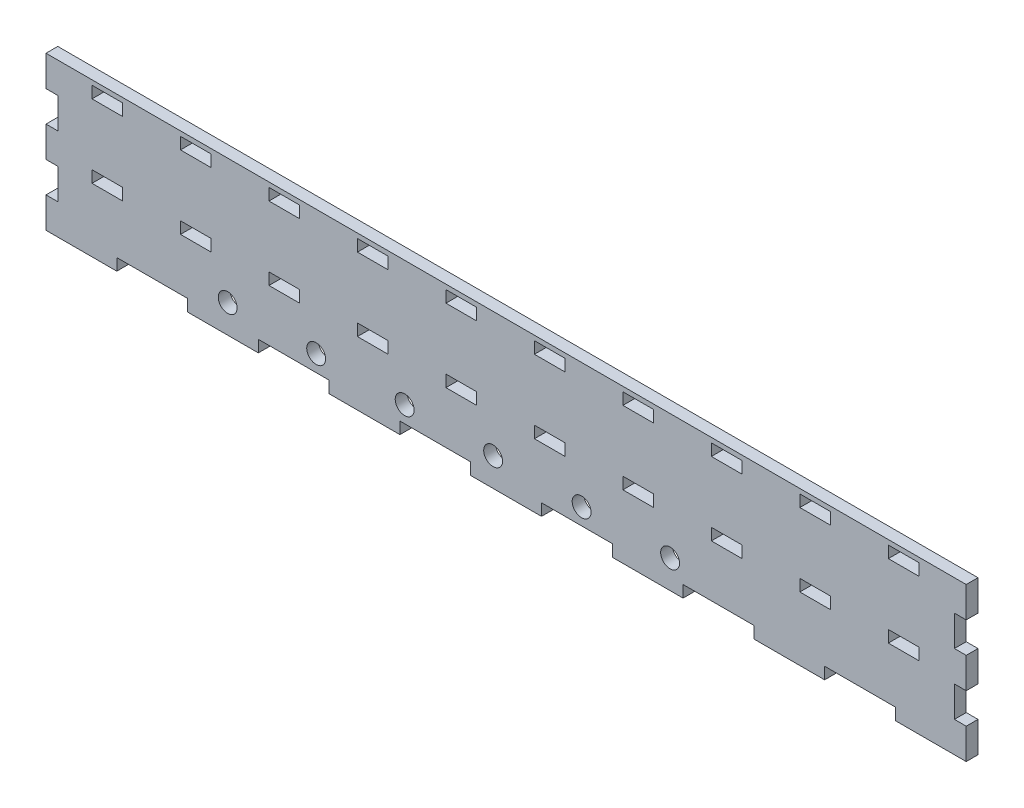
from build123d import *

# Parameters (mm, degrees)
ESQUISSE1_W                    = 390
ESQUISSE1_H                    = 65
BOSS_EXTRU_1_DEPTH             = 5
ESQUISSE2_W                    = 30
ESQUISSE2_H                    = 5
ENL_V_MAT_EXTRU_1_DEPTH        = 5
R_P_TITION_LIN_AIRE1_COUNT     = 6
R_P_TITION_LIN_AIRE1_PITCH     = 60
ESQUISSE3_W                    = 5
ESQUISSE3_H                    = 13
ENL_V_MAT_EXTRU_2_DEPTH        = 5
R_P_TITION_LIN_AIRE2_COUNT     = 2
R_P_TITION_LIN_AIRE2_PITCH     = 26
SYM_TRIE1_COPY_1_SKETCH_W      = 5
SYM_TRIE1_COPY_1_SKETCH_H      = 13
SYM_TRIE1_COPY_1_DEPTH         = 5
ESQUISSE4_R                    = 4
ENL_V_MAT_EXTRU_3_DEPTH        = 5
R_P_TITION_LIN_AIRE3_COUNT     = 6
R_P_TITION_LIN_AIRE3_PITCH     = 37.5
ESQUISSE5_W                    = 13
ESQUISSE5_H                    = 5
ENL_V_MAT_EXTRU_4_DEPTH        = 5
R_P_TITION_LIN_AIRE4_COUNT     = 2
R_P_TITION_LIN_AIRE4_PITCH     = 37.5
R_P_TITION_LIN_AIRE4_COL_COUNT = 9
R_P_TITION_LIN_AIRE4_COL_PITCH = 37.5


with BuildPart() as part:
    # Esquisse1 → Boss.-Extru.1 (new body)
    with BuildSketch(Plane.XY):
        with Locations((195, -32.5)):
            Rectangle(ESQUISSE1_W, ESQUISSE1_H)
    extrude(amount=BOSS_EXTRU_1_DEPTH)

    # Esquisse2 → Enl_v. mat.-Extru.1 (cut)
    with BuildSketch(Plane.XY.offset(5)):
        with Locations((45, -62.5)):
            Rectangle(ESQUISSE2_W, ESQUISSE2_H)
    enl_v_mat_extru_1 = extrude(amount=-ENL_V_MAT_EXTRU_1_DEPTH, mode=Mode.SUBTRACT)

    # R_p_tition lin_aire1: Enl_v. mat.-Extru.1 ×6
    with Locations(*[(i * R_P_TITION_LIN_AIRE1_PITCH, 0, 0) for i in range(1, R_P_TITION_LIN_AIRE1_COUNT)]):
        add(enl_v_mat_extru_1, mode=Mode.SUBTRACT)

    # Esquisse3 → Enl_v. mat.-Extru.2 (cut)
    with BuildSketch(Plane.XY.offset(5)):
        with Locations((2.5, -45.5)):
            Rectangle(ESQUISSE3_W, ESQUISSE3_H)
    enl_v_mat_extru_2 = extrude(amount=-ENL_V_MAT_EXTRU_2_DEPTH, mode=Mode.SUBTRACT)

    # R_p_tition lin_aire2: Enl_v. mat.-Extru.2 ×2
    with Locations(*[(0, i * R_P_TITION_LIN_AIRE2_PITCH, 0) for i in range(1, R_P_TITION_LIN_AIRE2_COUNT)]):
        add(enl_v_mat_extru_2, mode=Mode.SUBTRACT)

    # Sym_trie1: Enl_v. mat.-Extru.2 across plane
    add(enl_v_mat_extru_2.mirror(Plane.ZY.offset(-195)), mode=Mode.SUBTRACT)

    # Sym_trie1 copy 1 sketch → Sym_trie1 copy 1 (cut)
    with BuildSketch(Plane(origin=(390, 26, 5), x_dir=(-1, 0, 0), z_dir=(0, 0, 1))):
        with Locations((2.5, 45.5)):
            Rectangle(SYM_TRIE1_COPY_1_SKETCH_W, SYM_TRIE1_COPY_1_SKETCH_H)
    extrude(amount=-SYM_TRIE1_COPY_1_DEPTH, mode=Mode.SUBTRACT)

    # Esquisse4 → Enl_v. mat.-Extru.3 (cut)
    with BuildSketch(Plane.XY.offset(5)):
        with Locations((77, -53)):
            Circle(ESQUISSE4_R)
    enl_v_mat_extru_3 = extrude(amount=-ENL_V_MAT_EXTRU_3_DEPTH, mode=Mode.SUBTRACT)

    # R_p_tition lin_aire3: Enl_v. mat.-Extru.3 ×6
    with Locations(*[(i * R_P_TITION_LIN_AIRE3_PITCH, 0, 0) for i in range(1, R_P_TITION_LIN_AIRE3_COUNT)]):
        add(enl_v_mat_extru_3, mode=Mode.SUBTRACT)

    # Esquisse5 → Enl_v. mat.-Extru.4 (cut)
    with BuildSketch(Plane.XY.offset(5)):
        with Locations((63.5, -35.5)):
            Rectangle(ESQUISSE5_W, ESQUISSE5_H)
        with Locations((63.5, -4.5)):
            Rectangle(ESQUISSE5_W, ESQUISSE5_H)
    enl_v_mat_extru_4 = extrude(amount=-ENL_V_MAT_EXTRU_4_DEPTH, mode=Mode.SUBTRACT)

    # R_p_tition lin_aire4: Enl_v. mat.-Extru.4 ×2
    with Locations(*[(-i * R_P_TITION_LIN_AIRE4_PITCH, 0, 0) for i in range(1, R_P_TITION_LIN_AIRE4_COUNT)]):
        add(enl_v_mat_extru_4, mode=Mode.SUBTRACT)

    # R_p_tition lin_aire4 col: Enl_v. mat.-Extru.4 ×9
    with Locations(*[(i * R_P_TITION_LIN_AIRE4_COL_PITCH, 0, 0) for i in range(1, R_P_TITION_LIN_AIRE4_COL_COUNT)]):
        add(enl_v_mat_extru_4, mode=Mode.SUBTRACT)


solid = part.part
